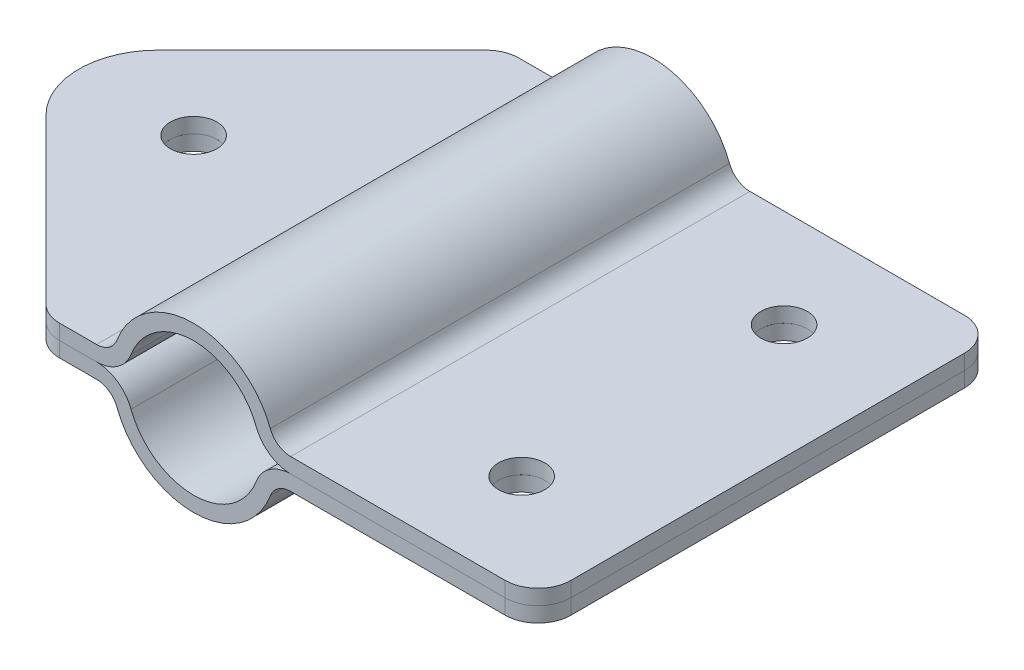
ISO-10303-21;
HEADER;
FILE_DESCRIPTION(('STEP AP214'),'2;1');
FILE_NAME('part.step','',(''),(''),'','','');
FILE_SCHEMA(('AUTOMOTIVE_DESIGN { 1 0 10303 214 1 1 1 1 }'));
ENDSEC;
DATA;
#1=APPLICATION_CONTEXT('core data for automotive mechanical design processes');
#2=APPLICATION_PROTOCOL_DEFINITION('international standard','automotive_design',2000,#1);
#3=PRODUCT_CONTEXT('',#1,'mechanical');
#4=PRODUCT('Part','Part','',(#3));
#5=PRODUCT_RELATED_PRODUCT_CATEGORY('part','',(#4));
#6=PRODUCT_DEFINITION_FORMATION('','',#4);
#7=PRODUCT_DEFINITION_CONTEXT('part definition',#1,'design');
#8=PRODUCT_DEFINITION('design','',#6,#7);
#9=PRODUCT_DEFINITION_SHAPE('','',#8);
#10=(LENGTH_UNIT() NAMED_UNIT(*) SI_UNIT(.MILLI.,.METRE.));
#11=(NAMED_UNIT(*) PLANE_ANGLE_UNIT() SI_UNIT($,.RADIAN.));
#12=(NAMED_UNIT(*) SI_UNIT($,.STERADIAN.) SOLID_ANGLE_UNIT());
#13=UNCERTAINTY_MEASURE_WITH_UNIT(LENGTH_MEASURE(1.E-05),#10,'distance_accuracy_value','');
#14=(GEOMETRIC_REPRESENTATION_CONTEXT(3) GLOBAL_UNCERTAINTY_ASSIGNED_CONTEXT((#13)) GLOBAL_UNIT_ASSIGNED_CONTEXT((#10,
#11,#12)) REPRESENTATION_CONTEXT('',''));
#15=CARTESIAN_POINT('',(0.,0.,0.));
#16=DIRECTION('',(0.,0.,1.));
#17=DIRECTION('',(1.,0.,0.));
#18=AXIS2_PLACEMENT_3D('',#15,#16,#17);
#19=CARTESIAN_POINT('',(-25.6723719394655,0.,0.));
#20=DIRECTION('',(0.,1.,0.));
#21=DIRECTION('',(0.,0.,1.));
#22=AXIS2_PLACEMENT_3D('',#19,#20,#21);
#23=CYLINDRICAL_SURFACE('',#22,7.66512806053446);
#24=DIRECTION('',(0.,1.,0.));
#25=VECTOR('',#24,1.);
#26=CARTESIAN_POINT('',(-31.0924359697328,0.,5.42006403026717));
#27=LINE('',#26,#25);
#28=CARTESIAN_POINT('',(-31.0924359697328,0.,5.42006403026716));
#29=VERTEX_POINT('',#28);
#30=CARTESIAN_POINT('',(-31.0924359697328,-1.46049999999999,5.42006403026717));
#31=VERTEX_POINT('',#30);
#32=EDGE_CURVE('P0_E217',#29,#31,#27,.F.);
#33=ORIENTED_EDGE('',*,*,#32,.F.);
#34=CARTESIAN_POINT('',(-25.6723719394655,0.,0.));
#35=DIRECTION('',(0.,-1.,0.));
#36=DIRECTION('',(-1.,0.,0.));
#37=AXIS2_PLACEMENT_3D('',#34,#35,#36);
#38=CIRCLE('',#37,7.66512806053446);
#39=CARTESIAN_POINT('',(-31.0924359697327,0.,-5.42006403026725));
#40=VERTEX_POINT('',#39);
#41=EDGE_CURVE('P0_E223',#40,#29,#38,.F.);
#42=ORIENTED_EDGE('',*,*,#41,.F.);
#43=DIRECTION('',(0.,-1.,0.));
#44=VECTOR('',#43,1.);
#45=CARTESIAN_POINT('',(-31.0924359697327,0.,-5.42006403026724));
#46=LINE('',#45,#44);
#47=CARTESIAN_POINT('',(-31.0924359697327,-1.46049999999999,-5.42006403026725));
#48=VERTEX_POINT('',#47);
#49=EDGE_CURVE('P0_E220',#48,#40,#46,.F.);
#50=ORIENTED_EDGE('',*,*,#49,.F.);
#51=CARTESIAN_POINT('',(-25.6723719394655,-1.46049999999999,0.));
#52=DIRECTION('',(0.,-1.,0.));
#53=DIRECTION('',(-1.,0.,0.));
#54=AXIS2_PLACEMENT_3D('',#51,#52,#53);
#55=CIRCLE('',#54,7.66512806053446);
#56=EDGE_CURVE('P0_E225',#31,#48,#55,.T.);
#57=ORIENTED_EDGE('',*,*,#56,.F.);
#58=EDGE_LOOP('',(#33,#42,#50,#57));
#59=FACE_BOUND('',#58,.T.);
#60=ADVANCED_FACE('P0_F18',(#59),#23,.T.);
#61=CARTESIAN_POINT('',(6.477,0.,-22.225));
#62=DIRECTION('',(0.,-1.,0.));
#63=DIRECTION('',(-1.,0.,0.));
#64=AXIS2_PLACEMENT_3D('',#61,#62,#63);
#65=PLANE('',#64);
#66=CARTESIAN_POINT('',(22.225,0.,12.7));
#67=DIRECTION('',(0.,-1.,0.));
#68=DIRECTION('',(0.,0.,-1.));
#69=AXIS2_PLACEMENT_3D('',#66,#67,#68);
#70=CIRCLE('',#69,2.2479);
#71=CARTESIAN_POINT('',(22.225,0.,10.4521));
#72=VERTEX_POINT('',#71);
#73=EDGE_CURVE('P0_E468',#72,#72,#70,.T.);
#74=ORIENTED_EDGE('',*,*,#73,.T.);
#75=EDGE_LOOP('',(#74));
#76=FACE_BOUND('',#75,.T.);
#77=CARTESIAN_POINT('',(22.225,0.,-12.7));
#78=DIRECTION('',(0.,-1.,0.));
#79=DIRECTION('',(0.,0.,-1.));
#80=AXIS2_PLACEMENT_3D('',#77,#78,#79);
#81=CIRCLE('',#80,2.2479);
#82=CARTESIAN_POINT('',(22.225,0.,-14.9479));
#83=VERTEX_POINT('',#82);
#84=EDGE_CURVE('P0_E478',#83,#83,#81,.T.);
#85=ORIENTED_EDGE('',*,*,#84,.T.);
#86=EDGE_LOOP('',(#85));
#87=FACE_BOUND('',#86,.T.);
#88=DIRECTION('',(0.,0.,1.));
#89=VECTOR('',#88,1.);
#90=CARTESIAN_POINT('',(33.3375,0.,-22.225));
#91=LINE('',#90,#89);
#92=CARTESIAN_POINT('',(33.3375,0.,-19.05));
#93=VERTEX_POINT('',#92);
#94=CARTESIAN_POINT('',(33.3375,0.,19.05));
#95=VERTEX_POINT('',#94);
#96=EDGE_CURVE('P0_E172',#93,#95,#91,.T.);
#97=ORIENTED_EDGE('',*,*,#96,.F.);
#98=CARTESIAN_POINT('',(30.1625,0.,-19.05));
#99=DIRECTION('',(0.,-1.,0.));
#100=DIRECTION('',(-1.,0.,0.));
#101=AXIS2_PLACEMENT_3D('',#98,#99,#100);
#102=CIRCLE('',#101,3.175);
#103=CARTESIAN_POINT('',(30.1625,0.,-22.225));
#104=VERTEX_POINT('',#103);
#105=EDGE_CURVE('P0_E41',#93,#104,#102,.F.);
#106=ORIENTED_EDGE('',*,*,#105,.T.);
#107=DIRECTION('',(1.,0.,0.));
#108=VECTOR('',#107,1.);
#109=CARTESIAN_POINT('',(6.477,0.,-22.225));
#110=LINE('',#109,#108);
#111=CARTESIAN_POINT('',(9.39263529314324,0.,-22.225));
#112=VERTEX_POINT('',#111);
#113=EDGE_CURVE('P0_E274',#112,#104,#110,.T.);
#114=ORIENTED_EDGE('',*,*,#113,.F.);
#115=DIRECTION('',(0.,0.,1.));
#116=VECTOR('',#115,1.);
#117=CARTESIAN_POINT('',(9.39263529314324,0.,-22.225));
#118=LINE('',#117,#116);
#119=CARTESIAN_POINT('',(9.39263529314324,0.,22.225));
#120=VERTEX_POINT('',#119);
#121=EDGE_CURVE('P0_E183',#112,#120,#118,.T.);
#122=ORIENTED_EDGE('',*,*,#121,.T.);
#123=DIRECTION('',(1.,0.,0.));
#124=VECTOR('',#123,1.);
#125=CARTESIAN_POINT('',(6.477,0.,22.225));
#126=LINE('',#125,#124);
#127=CARTESIAN_POINT('',(30.1625,0.,22.225));
#128=VERTEX_POINT('',#127);
#129=EDGE_CURVE('P0_E267',#120,#128,#126,.T.);
#130=ORIENTED_EDGE('',*,*,#129,.T.);
#131=CARTESIAN_POINT('',(30.1625,0.,19.05));
#132=DIRECTION('',(0.,-1.,0.));
#133=DIRECTION('',(-1.,0.,0.));
#134=AXIS2_PLACEMENT_3D('',#131,#132,#133);
#135=CIRCLE('',#134,3.175);
#136=EDGE_CURVE('P0_E33',#128,#95,#135,.F.);
#137=ORIENTED_EDGE('',*,*,#136,.T.);
#138=EDGE_LOOP('',(#97,#106,#114,#122,#130,#137));
#139=FACE_BOUND('',#138,.T.);
#140=ADVANCED_FACE('P0_F271',(#76,#87,#139),#65,.F.);
#141=CARTESIAN_POINT('',(33.3375,-1.4605,-22.225));
#142=DIRECTION('',(1.,0.,0.));
#143=DIRECTION('',(0.,0.,1.));
#144=AXIS2_PLACEMENT_3D('',#141,#142,#143);
#145=PLANE('',#144);
#146=DIRECTION('',(0.,0.,1.));
#147=VECTOR('',#146,1.);
#148=CARTESIAN_POINT('',(33.3375,-1.4605,-22.225));
#149=LINE('',#148,#147);
#150=CARTESIAN_POINT('',(33.3375,-1.4605,-19.05));
#151=VERTEX_POINT('',#150);
#152=CARTESIAN_POINT('',(33.3375,-1.4605,19.05));
#153=VERTEX_POINT('',#152);
#154=EDGE_CURVE('P0_E176',#151,#153,#149,.T.);
#155=ORIENTED_EDGE('',*,*,#154,.F.);
#156=DIRECTION('',(0.,1.,0.));
#157=VECTOR('',#156,1.);
#158=CARTESIAN_POINT('',(33.3375,-1.4605,-19.05));
#159=LINE('',#158,#157);
#160=EDGE_CURVE('P0_E251',#151,#93,#159,.T.);
#161=ORIENTED_EDGE('',*,*,#160,.T.);
#162=ORIENTED_EDGE('',*,*,#96,.T.);
#163=DIRECTION('',(0.,1.,0.));
#164=VECTOR('',#163,1.);
#165=CARTESIAN_POINT('',(33.3375,-1.4605,19.05));
#166=LINE('',#165,#164);
#167=EDGE_CURVE('P0_E249',#95,#153,#166,.F.);
#168=ORIENTED_EDGE('',*,*,#167,.T.);
#169=EDGE_LOOP('',(#155,#161,#162,#168));
#170=FACE_BOUND('',#169,.T.);
#171=ADVANCED_FACE('P0_F270',(#170),#145,.T.);
#172=CARTESIAN_POINT('',(6.477,-1.4605,-22.225));
#173=DIRECTION('',(0.,-1.,0.));
#174=DIRECTION('',(-1.,0.,0.));
#175=AXIS2_PLACEMENT_3D('',#172,#173,#174);
#176=PLANE('',#175);
#177=CARTESIAN_POINT('',(22.225,-1.4605,12.7));
#178=DIRECTION('',(0.,-1.,0.));
#179=DIRECTION('',(0.,0.,-1.));
#180=AXIS2_PLACEMENT_3D('',#177,#178,#179);
#181=CIRCLE('',#180,2.24789999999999);
#182=CARTESIAN_POINT('',(22.225,-1.4605,10.4521));
#183=VERTEX_POINT('',#182);
#184=EDGE_CURVE('P0_E471',#183,#183,#181,.T.);
#185=ORIENTED_EDGE('',*,*,#184,.F.);
#186=EDGE_LOOP('',(#185));
#187=FACE_BOUND('',#186,.T.);
#188=CARTESIAN_POINT('',(22.225,-1.4605,-12.7));
#189=DIRECTION('',(0.,-1.,0.));
#190=DIRECTION('',(0.,0.,-1.));
#191=AXIS2_PLACEMENT_3D('',#188,#189,#190);
#192=CIRCLE('',#191,2.24789999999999);
#193=CARTESIAN_POINT('',(22.225,-1.4605,-14.9479));
#194=VERTEX_POINT('',#193);
#195=EDGE_CURVE('P0_E473',#194,#194,#192,.T.);
#196=ORIENTED_EDGE('',*,*,#195,.F.);
#197=EDGE_LOOP('',(#196));
#198=FACE_BOUND('',#197,.T.);
#199=DIRECTION('',(1.,0.,0.));
#200=VECTOR('',#199,1.);
#201=CARTESIAN_POINT('',(6.477,-1.4605,-22.225));
#202=LINE('',#201,#200);
#203=CARTESIAN_POINT('',(9.39263529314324,-1.4605,-22.225));
#204=VERTEX_POINT('',#203);
#205=CARTESIAN_POINT('',(30.1625,-1.4605,-22.225));
#206=VERTEX_POINT('',#205);
#207=EDGE_CURVE('P0_E282',#204,#206,#202,.T.);
#208=ORIENTED_EDGE('',*,*,#207,.T.);
#209=CARTESIAN_POINT('',(30.1625,-1.4605,-19.05));
#210=DIRECTION('',(0.,-1.,0.));
#211=DIRECTION('',(-1.,0.,0.));
#212=AXIS2_PLACEMENT_3D('',#209,#210,#211);
#213=CIRCLE('',#212,3.175);
#214=EDGE_CURVE('P0_E12',#206,#151,#213,.T.);
#215=ORIENTED_EDGE('',*,*,#214,.T.);
#216=ORIENTED_EDGE('',*,*,#154,.T.);
#217=CARTESIAN_POINT('',(30.1625,-1.4605,19.05));
#218=DIRECTION('',(0.,-1.,0.));
#219=DIRECTION('',(-1.,0.,0.));
#220=AXIS2_PLACEMENT_3D('',#217,#218,#219);
#221=CIRCLE('',#220,3.175);
#222=CARTESIAN_POINT('',(30.1625,-1.4605,22.225));
#223=VERTEX_POINT('',#222);
#224=EDGE_CURVE('P0_E26',#153,#223,#221,.T.);
#225=ORIENTED_EDGE('',*,*,#224,.T.);
#226=DIRECTION('',(1.,0.,0.));
#227=VECTOR('',#226,1.);
#228=CARTESIAN_POINT('',(6.477,-1.4605,22.225));
#229=LINE('',#228,#227);
#230=CARTESIAN_POINT('',(9.39263529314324,-1.4605,22.225));
#231=VERTEX_POINT('',#230);
#232=EDGE_CURVE('P0_E167',#231,#223,#229,.T.);
#233=ORIENTED_EDGE('',*,*,#232,.F.);
#234=DIRECTION('',(0.,0.,-1.));
#235=VECTOR('',#234,1.);
#236=CARTESIAN_POINT('',(9.39263529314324,-1.4605,-22.225));
#237=LINE('',#236,#235);
#238=EDGE_CURVE('P0_E174',#231,#204,#237,.T.);
#239=ORIENTED_EDGE('',*,*,#238,.T.);
#240=EDGE_LOOP('',(#208,#215,#216,#225,#233,#239));
#241=FACE_BOUND('',#240,.T.);
#242=ADVANCED_FACE('P0_F260',(#187,#198,#241),#176,.T.);
#243=CARTESIAN_POINT('',(0.,0.,-22.225));
#244=DIRECTION('',(0.,0.,1.));
#245=DIRECTION('',(-1.,0.,0.));
#246=AXIS2_PLACEMENT_3D('',#243,#244,#245);
#247=CYLINDRICAL_SURFACE('',#246,7.9375);
#248=CARTESIAN_POINT('',(0.,0.,-22.225));
#249=DIRECTION('',(0.,0.,-1.));
#250=DIRECTION('',(1.,0.,0.));
#251=AXIS2_PLACEMENT_3D('',#248,#249,#250);
#252=CIRCLE('',#251,7.9375);
#253=CARTESIAN_POINT('',(-7.41914320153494,-2.82138625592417,-22.225));
#254=VERTEX_POINT('',#253);
#255=CARTESIAN_POINT('',(7.41914320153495,-2.82138625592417,-22.225));
#256=VERTEX_POINT('',#255);
#257=EDGE_CURVE('P0_E288',#254,#256,#252,.F.);
#258=ORIENTED_EDGE('',*,*,#257,.T.);
#259=DIRECTION('',(0.,0.,1.));
#260=VECTOR('',#259,1.);
#261=CARTESIAN_POINT('',(7.41914320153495,-2.82138625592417,-22.225));
#262=LINE('',#261,#260);
#263=CARTESIAN_POINT('',(7.41914320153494,-2.82138625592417,22.225));
#264=VERTEX_POINT('',#263);
#265=EDGE_CURVE('P0_E166',#256,#264,#262,.T.);
#266=ORIENTED_EDGE('',*,*,#265,.T.);
#267=CARTESIAN_POINT('',(0.,0.,22.225));
#268=DIRECTION('',(0.,0.,-1.));
#269=DIRECTION('',(1.,0.,0.));
#270=AXIS2_PLACEMENT_3D('',#267,#268,#269);
#271=CIRCLE('',#270,7.9375);
#272=CARTESIAN_POINT('',(-7.41914320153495,-2.82138625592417,22.225));
#273=VERTEX_POINT('',#272);
#274=EDGE_CURVE('P0_E148',#273,#264,#271,.F.);
#275=ORIENTED_EDGE('',*,*,#274,.F.);
#276=DIRECTION('',(0.,0.,1.));
#277=VECTOR('',#276,1.);
#278=CARTESIAN_POINT('',(-7.41914320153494,-2.82138625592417,-22.225));
#279=LINE('',#278,#277);
#280=EDGE_CURVE('P0_E163',#273,#254,#279,.F.);
#281=ORIENTED_EDGE('',*,*,#280,.T.);
#282=EDGE_LOOP('',(#258,#266,#275,#281));
#283=FACE_BOUND('',#282,.T.);
#284=ADVANCED_FACE('P0_F162',(#283),#247,.T.);
#285=CARTESIAN_POINT('',(-6.477,-1.4605,-22.225));
#286=DIRECTION('',(0.,-1.,0.));
#287=DIRECTION('',(-1.,0.,0.));
#288=AXIS2_PLACEMENT_3D('',#285,#286,#287);
#289=PLANE('',#288);
#290=CARTESIAN_POINT('',(-22.225,-1.4605,0.));
#291=DIRECTION('',(0.,-1.,0.));
#292=DIRECTION('',(0.,0.,-1.));
#293=AXIS2_PLACEMENT_3D('',#290,#291,#292);
#294=CIRCLE('',#293,2.24789999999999);
#295=CARTESIAN_POINT('',(-22.225,-1.4605,-2.24789999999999));
#296=VERTEX_POINT('',#295);
#297=EDGE_CURVE('P0_E481',#296,#296,#294,.T.);
#298=ORIENTED_EDGE('',*,*,#297,.F.);
#299=EDGE_LOOP('',(#298));
#300=FACE_BOUND('',#299,.T.);
#301=DIRECTION('',(-0.707106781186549,0.,0.707106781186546));
#302=VECTOR('',#301,1.);
#303=CARTESIAN_POINT('',(-10.3822499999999,-1.4605,-26.13025));
#304=LINE('',#303,#302);
#305=CARTESIAN_POINT('',(-15.2174359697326,-1.4605,-21.2950640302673));
#306=VERTEX_POINT('',#305);
#307=EDGE_CURVE('P0_E209',#48,#306,#304,.F.);
#308=ORIENTED_EDGE('',*,*,#307,.T.);
#309=CARTESIAN_POINT('',(-12.9723719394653,-1.4605,-19.05));
#310=DIRECTION('',(0.,-1.,0.));
#311=DIRECTION('',(-1.,0.,0.));
#312=AXIS2_PLACEMENT_3D('',#309,#310,#311);
#313=CIRCLE('',#312,3.175);
#314=CARTESIAN_POINT('',(-12.9723719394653,-1.4605,-22.225));
#315=VERTEX_POINT('',#314);
#316=EDGE_CURVE('P0_E240',#306,#315,#313,.T.);
#317=ORIENTED_EDGE('',*,*,#316,.T.);
#318=DIRECTION('',(1.,0.,0.));
#319=VECTOR('',#318,1.);
#320=CARTESIAN_POINT('',(-6.477,-1.4605,-22.225));
#321=LINE('',#320,#319);
#322=CARTESIAN_POINT('',(-9.39263529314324,-1.4605,-22.225));
#323=VERTEX_POINT('',#322);
#324=EDGE_CURVE('P0_E290',#315,#323,#321,.T.);
#325=ORIENTED_EDGE('',*,*,#324,.T.);
#326=DIRECTION('',(0.,0.,-1.));
#327=VECTOR('',#326,1.);
#328=CARTESIAN_POINT('',(-9.39263529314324,-1.4605,22.225));
#329=LINE('',#328,#327);
#330=CARTESIAN_POINT('',(-9.39263529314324,-1.4605,22.225));
#331=VERTEX_POINT('',#330);
#332=EDGE_CURVE('P0_E181',#323,#331,#329,.F.);
#333=ORIENTED_EDGE('',*,*,#332,.T.);
#334=DIRECTION('',(1.,0.,0.));
#335=VECTOR('',#334,1.);
#336=CARTESIAN_POINT('',(-6.477,-1.4605,22.225));
#337=LINE('',#336,#335);
#338=CARTESIAN_POINT('',(-12.9723719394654,-1.4605,22.225));
#339=VERTEX_POINT('',#338);
#340=EDGE_CURVE('P0_E151',#339,#331,#337,.T.);
#341=ORIENTED_EDGE('',*,*,#340,.F.);
#342=CARTESIAN_POINT('',(-12.9723719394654,-1.4605,19.05));
#343=DIRECTION('',(0.,-1.,0.));
#344=DIRECTION('',(-1.,0.,0.));
#345=AXIS2_PLACEMENT_3D('',#342,#343,#344);
#346=CIRCLE('',#345,3.175);
#347=CARTESIAN_POINT('',(-15.2174359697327,-1.4605,21.2950640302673));
#348=VERTEX_POINT('',#347);
#349=EDGE_CURVE('P0_E238',#339,#348,#346,.T.);
#350=ORIENTED_EDGE('',*,*,#349,.T.);
#351=DIRECTION('',(-0.707106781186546,0.,-0.707106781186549));
#352=VECTOR('',#351,1.);
#353=CARTESIAN_POINT('',(-32.60725,-1.46049999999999,3.90524999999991));
#354=LINE('',#353,#352);
#355=EDGE_CURVE('P0_E207',#348,#31,#354,.T.);
#356=ORIENTED_EDGE('',*,*,#355,.T.);
#357=ORIENTED_EDGE('',*,*,#56,.T.);
#358=EDGE_LOOP('',(#308,#317,#325,#333,#341,#350,#356,#357));
#359=FACE_BOUND('',#358,.T.);
#360=ADVANCED_FACE('P0_F377',(#300,#359),#289,.T.);
#361=CARTESIAN_POINT('',(-6.477,0.,-22.225));
#362=DIRECTION('',(0.,-1.,0.));
#363=DIRECTION('',(-1.,0.,0.));
#364=AXIS2_PLACEMENT_3D('',#361,#362,#363);
#365=PLANE('',#364);
#366=CARTESIAN_POINT('',(-22.225,0.,0.));
#367=DIRECTION('',(0.,-1.,0.));
#368=DIRECTION('',(0.,0.,-1.));
#369=AXIS2_PLACEMENT_3D('',#366,#367,#368);
#370=CIRCLE('',#369,2.2479);
#371=CARTESIAN_POINT('',(-22.225,0.,-2.2479));
#372=VERTEX_POINT('',#371);
#373=EDGE_CURVE('P0_E299',#372,#372,#370,.T.);
#374=ORIENTED_EDGE('',*,*,#373,.T.);
#375=EDGE_LOOP('',(#374));
#376=FACE_BOUND('',#375,.T.);
#377=DIRECTION('',(1.,0.,0.));
#378=VECTOR('',#377,1.);
#379=CARTESIAN_POINT('',(-6.477,0.,-22.225));
#380=LINE('',#379,#378);
#381=CARTESIAN_POINT('',(-12.9723719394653,0.,-22.225));
#382=VERTEX_POINT('',#381);
#383=CARTESIAN_POINT('',(-9.39263529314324,0.,-22.225));
#384=VERTEX_POINT('',#383);
#385=EDGE_CURVE('P0_E295',#382,#384,#380,.T.);
#386=ORIENTED_EDGE('',*,*,#385,.F.);
#387=CARTESIAN_POINT('',(-12.9723719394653,0.,-19.05));
#388=DIRECTION('',(0.,-1.,0.));
#389=DIRECTION('',(-1.,0.,0.));
#390=AXIS2_PLACEMENT_3D('',#387,#388,#389);
#391=CIRCLE('',#390,3.175);
#392=CARTESIAN_POINT('',(-15.2174359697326,0.,-21.2950640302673));
#393=VERTEX_POINT('',#392);
#394=EDGE_CURVE('P0_E234',#382,#393,#391,.F.);
#395=ORIENTED_EDGE('',*,*,#394,.T.);
#396=DIRECTION('',(0.707106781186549,0.,-0.707106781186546));
#397=VECTOR('',#396,1.);
#398=CARTESIAN_POINT('',(-33.3375,0.,-3.17499999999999));
#399=LINE('',#398,#397);
#400=EDGE_CURVE('P0_E215',#393,#40,#399,.F.);
#401=ORIENTED_EDGE('',*,*,#400,.T.);
#402=ORIENTED_EDGE('',*,*,#41,.T.);
#403=DIRECTION('',(0.707106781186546,0.,0.707106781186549));
#404=VECTOR('',#403,1.);
#405=CARTESIAN_POINT('',(-14.2875,0.,22.225));
#406=LINE('',#405,#404);
#407=CARTESIAN_POINT('',(-15.2174359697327,0.,21.2950640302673));
#408=VERTEX_POINT('',#407);
#409=EDGE_CURVE('P0_E212',#29,#408,#406,.T.);
#410=ORIENTED_EDGE('',*,*,#409,.T.);
#411=CARTESIAN_POINT('',(-12.9723719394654,0.,19.05));
#412=DIRECTION('',(0.,-1.,0.));
#413=DIRECTION('',(-1.,0.,0.));
#414=AXIS2_PLACEMENT_3D('',#411,#412,#413);
#415=CIRCLE('',#414,3.175);
#416=CARTESIAN_POINT('',(-12.9723719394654,0.,22.225));
#417=VERTEX_POINT('',#416);
#418=EDGE_CURVE('P0_E232',#408,#417,#415,.F.);
#419=ORIENTED_EDGE('',*,*,#418,.T.);
#420=DIRECTION('',(1.,0.,0.));
#421=VECTOR('',#420,1.);
#422=CARTESIAN_POINT('',(-6.477,0.,22.225));
#423=LINE('',#422,#421);
#424=CARTESIAN_POINT('',(-9.39263529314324,0.,22.225));
#425=VERTEX_POINT('',#424);
#426=EDGE_CURVE('P0_E302',#417,#425,#423,.T.);
#427=ORIENTED_EDGE('',*,*,#426,.T.);
#428=DIRECTION('',(0.,0.,1.));
#429=VECTOR('',#428,1.);
#430=CARTESIAN_POINT('',(-9.39263529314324,0.,-22.225));
#431=LINE('',#430,#429);
#432=EDGE_CURVE('P0_E200',#425,#384,#431,.F.);
#433=ORIENTED_EDGE('',*,*,#432,.T.);
#434=EDGE_LOOP('',(#386,#395,#401,#402,#410,#419,#427,#433));
#435=FACE_BOUND('',#434,.T.);
#436=ADVANCED_FACE('P0_F374',(#376,#435),#365,.F.);
#437=CARTESIAN_POINT('',(0.,0.,-22.225));
#438=DIRECTION('',(0.,0.,1.));
#439=DIRECTION('',(-1.,0.,0.));
#440=AXIS2_PLACEMENT_3D('',#437,#438,#439);
#441=CYLINDRICAL_SURFACE('',#440,6.477);
#442=CARTESIAN_POINT('',(0.,0.,22.225));
#443=DIRECTION('',(0.,0.,1.));
#444=DIRECTION('',(1.,0.,0.));
#445=AXIS2_PLACEMENT_3D('',#442,#443,#444);
#446=CIRCLE('',#445,6.477);
#447=CARTESIAN_POINT('',(-6.05402085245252,-2.30225118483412,22.225));
#448=VERTEX_POINT('',#447);
#449=CARTESIAN_POINT('',(6.05402085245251,-2.30225118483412,22.225));
#450=VERTEX_POINT('',#449);
#451=EDGE_CURVE('P0_E283',#448,#450,#446,.T.);
#452=ORIENTED_EDGE('',*,*,#451,.T.);
#453=DIRECTION('',(0.,0.,1.));
#454=VECTOR('',#453,1.);
#455=CARTESIAN_POINT('',(6.05402085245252,-2.30225118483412,-22.225));
#456=LINE('',#455,#454);
#457=CARTESIAN_POINT('',(6.05402085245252,-2.30225118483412,-22.225));
#458=VERTEX_POINT('',#457);
#459=EDGE_CURVE('P0_E194',#450,#458,#456,.F.);
#460=ORIENTED_EDGE('',*,*,#459,.T.);
#461=CARTESIAN_POINT('',(0.,0.,-22.225));
#462=DIRECTION('',(0.,0.,1.));
#463=DIRECTION('',(1.,0.,0.));
#464=AXIS2_PLACEMENT_3D('',#461,#462,#463);
#465=CIRCLE('',#464,6.477);
#466=CARTESIAN_POINT('',(-6.05402085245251,-2.30225118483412,-22.225));
#467=VERTEX_POINT('',#466);
#468=EDGE_CURVE('P0_E297',#467,#458,#465,.T.);
#469=ORIENTED_EDGE('',*,*,#468,.F.);
#470=DIRECTION('',(0.,0.,1.));
#471=VECTOR('',#470,1.);
#472=CARTESIAN_POINT('',(-6.05402085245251,-2.30225118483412,-22.225));
#473=LINE('',#472,#471);
#474=EDGE_CURVE('P0_E191',#467,#448,#473,.T.);
#475=ORIENTED_EDGE('',*,*,#474,.T.);
#476=EDGE_LOOP('',(#452,#460,#469,#475));
#477=FACE_BOUND('',#476,.T.);
#478=ADVANCED_FACE('P0_F308',(#477),#441,.F.);
#479=CARTESIAN_POINT('',(0.,0.,-22.225));
#480=DIRECTION('',(0.,0.,-1.));
#481=DIRECTION('',(1.,0.,0.));
#482=AXIS2_PLACEMENT_3D('',#479,#480,#481);
#483=PLANE('',#482);
#484=ORIENTED_EDGE('',*,*,#324,.F.);
#485=DIRECTION('',(0.,-1.,0.));
#486=VECTOR('',#485,1.);
#487=CARTESIAN_POINT('',(-12.9723719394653,0.,-22.225));
#488=LINE('',#487,#486);
#489=EDGE_CURVE('P0_E229',#315,#382,#488,.F.);
#490=ORIENTED_EDGE('',*,*,#489,.T.);
#491=ORIENTED_EDGE('',*,*,#385,.T.);
#492=CARTESIAN_POINT('',(-9.39263529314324,-3.571875,-22.225));
#493=DIRECTION('',(0.,0.,-1.));
#494=DIRECTION('',(1.,0.,0.));
#495=AXIS2_PLACEMENT_3D('',#492,#493,#494);
#496=CIRCLE('',#495,3.571875);
#497=EDGE_CURVE('P0_E196',#384,#467,#496,.T.);
#498=ORIENTED_EDGE('',*,*,#497,.T.);
#499=ORIENTED_EDGE('',*,*,#468,.T.);
#500=CARTESIAN_POINT('',(9.39263529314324,-3.571875,-22.225));
#501=DIRECTION('',(0.,0.,-1.));
#502=DIRECTION('',(1.,0.,0.));
#503=AXIS2_PLACEMENT_3D('',#500,#501,#502);
#504=CIRCLE('',#503,3.571875);
#505=EDGE_CURVE('P0_E198',#458,#112,#504,.T.);
#506=ORIENTED_EDGE('',*,*,#505,.T.);
#507=ORIENTED_EDGE('',*,*,#113,.T.);
#508=DIRECTION('',(0.,1.,0.));
#509=VECTOR('',#508,1.);
#510=CARTESIAN_POINT('',(30.1625,0.,-22.225));
#511=LINE('',#510,#509);
#512=EDGE_CURVE('P0_E227',#104,#206,#511,.F.);
#513=ORIENTED_EDGE('',*,*,#512,.T.);
#514=ORIENTED_EDGE('',*,*,#207,.F.);
#515=CARTESIAN_POINT('',(9.39263529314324,-3.571875,-22.225));
#516=DIRECTION('',(0.,0.,-1.));
#517=DIRECTION('',(1.,0.,0.));
#518=AXIS2_PLACEMENT_3D('',#515,#516,#517);
#519=CIRCLE('',#518,2.111375);
#520=EDGE_CURVE('P0_E157',#204,#256,#519,.F.);
#521=ORIENTED_EDGE('',*,*,#520,.T.);
#522=ORIENTED_EDGE('',*,*,#257,.F.);
#523=CARTESIAN_POINT('',(-9.39263529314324,-3.571875,-22.225));
#524=DIRECTION('',(0.,0.,-1.));
#525=DIRECTION('',(1.,0.,0.));
#526=AXIS2_PLACEMENT_3D('',#523,#524,#525);
#527=CIRCLE('',#526,2.111375);
#528=EDGE_CURVE('P0_E156',#254,#323,#527,.F.);
#529=ORIENTED_EDGE('',*,*,#528,.T.);
#530=EDGE_LOOP('',(#484,#490,#491,#498,#499,#506,#507,#513,#514,#521,#522,#529));
#531=FACE_BOUND('',#530,.T.);
#532=ADVANCED_FACE('P0_F278',(#531),#483,.T.);
#533=CARTESIAN_POINT('',(0.,0.,22.225));
#534=DIRECTION('',(0.,0.,-1.));
#535=DIRECTION('',(1.,0.,0.));
#536=AXIS2_PLACEMENT_3D('',#533,#534,#535);
#537=PLANE('',#536);
#538=ORIENTED_EDGE('',*,*,#426,.F.);
#539=DIRECTION('',(0.,-1.,0.));
#540=VECTOR('',#539,1.);
#541=CARTESIAN_POINT('',(-12.9723719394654,-1.4605,22.225));
#542=LINE('',#541,#540);
#543=EDGE_CURVE('P0_E245',#417,#339,#542,.T.);
#544=ORIENTED_EDGE('',*,*,#543,.T.);
#545=ORIENTED_EDGE('',*,*,#340,.T.);
#546=CARTESIAN_POINT('',(-9.39263529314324,-3.571875,22.225));
#547=DIRECTION('',(0.,0.,-1.));
#548=DIRECTION('',(1.,0.,0.));
#549=AXIS2_PLACEMENT_3D('',#546,#547,#548);
#550=CIRCLE('',#549,2.111375);
#551=EDGE_CURVE('P0_E144',#331,#273,#550,.T.);
#552=ORIENTED_EDGE('',*,*,#551,.T.);
#553=ORIENTED_EDGE('',*,*,#274,.T.);
#554=CARTESIAN_POINT('',(9.39263529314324,-3.571875,22.225));
#555=DIRECTION('',(0.,0.,-1.));
#556=DIRECTION('',(1.,0.,0.));
#557=AXIS2_PLACEMENT_3D('',#554,#555,#556);
#558=CIRCLE('',#557,2.111375);
#559=EDGE_CURVE('P0_E203',#264,#231,#558,.T.);
#560=ORIENTED_EDGE('',*,*,#559,.T.);
#561=ORIENTED_EDGE('',*,*,#232,.T.);
#562=DIRECTION('',(0.,1.,0.));
#563=VECTOR('',#562,1.);
#564=CARTESIAN_POINT('',(30.1625,0.,22.225));
#565=LINE('',#564,#563);
#566=EDGE_CURVE('P0_E242',#223,#128,#565,.T.);
#567=ORIENTED_EDGE('',*,*,#566,.T.);
#568=ORIENTED_EDGE('',*,*,#129,.F.);
#569=CARTESIAN_POINT('',(9.39263529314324,-3.571875,22.225));
#570=DIRECTION('',(0.,0.,-1.));
#571=DIRECTION('',(1.,0.,0.));
#572=AXIS2_PLACEMENT_3D('',#569,#570,#571);
#573=CIRCLE('',#572,3.571875);
#574=EDGE_CURVE('P0_E189',#120,#450,#573,.F.);
#575=ORIENTED_EDGE('',*,*,#574,.T.);
#576=ORIENTED_EDGE('',*,*,#451,.F.);
#577=CARTESIAN_POINT('',(-9.39263529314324,-3.571875,22.225));
#578=DIRECTION('',(0.,0.,-1.));
#579=DIRECTION('',(1.,0.,0.));
#580=AXIS2_PLACEMENT_3D('',#577,#578,#579);
#581=CIRCLE('',#580,3.571875);
#582=EDGE_CURVE('P0_E186',#448,#425,#581,.F.);
#583=ORIENTED_EDGE('',*,*,#582,.T.);
#584=EDGE_LOOP('',(#538,#544,#545,#552,#553,#560,#561,#567,#568,#575,#576,#583));
#585=FACE_BOUND('',#584,.T.);
#586=ADVANCED_FACE('P0_F147',(#585),#537,.F.);
#587=CARTESIAN_POINT('',(9.39263529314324,-3.571875,-22.225));
#588=DIRECTION('',(0.,0.,1.));
#589=DIRECTION('',(-1.,0.,0.));
#590=AXIS2_PLACEMENT_3D('',#587,#588,#589);
#591=CYLINDRICAL_SURFACE('',#590,2.111375);
#592=ORIENTED_EDGE('',*,*,#520,.F.);
#593=ORIENTED_EDGE('',*,*,#238,.F.);
#594=ORIENTED_EDGE('',*,*,#559,.F.);
#595=ORIENTED_EDGE('',*,*,#265,.F.);
#596=EDGE_LOOP('',(#592,#593,#594,#595));
#597=FACE_BOUND('',#596,.T.);
#598=ADVANCED_FACE('P0_F324',(#597),#591,.F.);
#599=CARTESIAN_POINT('',(-9.39263529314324,-3.571875,-22.225));
#600=DIRECTION('',(0.,0.,1.));
#601=DIRECTION('',(-1.,0.,0.));
#602=AXIS2_PLACEMENT_3D('',#599,#600,#601);
#603=CYLINDRICAL_SURFACE('',#602,2.111375);
#604=ORIENTED_EDGE('',*,*,#528,.F.);
#605=ORIENTED_EDGE('',*,*,#280,.F.);
#606=ORIENTED_EDGE('',*,*,#551,.F.);
#607=ORIENTED_EDGE('',*,*,#332,.F.);
#608=EDGE_LOOP('',(#604,#605,#606,#607));
#609=FACE_BOUND('',#608,.T.);
#610=ADVANCED_FACE('P0_F170',(#609),#603,.F.);
#611=CARTESIAN_POINT('',(9.39263529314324,-3.571875,-22.225));
#612=DIRECTION('',(0.,0.,1.));
#613=DIRECTION('',(-1.,0.,0.));
#614=AXIS2_PLACEMENT_3D('',#611,#612,#613);
#615=CYLINDRICAL_SURFACE('',#614,3.571875);
#616=ORIENTED_EDGE('',*,*,#505,.F.);
#617=ORIENTED_EDGE('',*,*,#459,.F.);
#618=ORIENTED_EDGE('',*,*,#574,.F.);
#619=ORIENTED_EDGE('',*,*,#121,.F.);
#620=EDGE_LOOP('',(#616,#617,#618,#619));
#621=FACE_BOUND('',#620,.T.);
#622=ADVANCED_FACE('P0_F312',(#621),#615,.T.);
#623=CARTESIAN_POINT('',(-9.39263529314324,-3.571875,-22.225));
#624=DIRECTION('',(0.,0.,1.));
#625=DIRECTION('',(-1.,0.,0.));
#626=AXIS2_PLACEMENT_3D('',#623,#624,#625);
#627=CYLINDRICAL_SURFACE('',#626,3.571875);
#628=ORIENTED_EDGE('',*,*,#497,.F.);
#629=ORIENTED_EDGE('',*,*,#432,.F.);
#630=ORIENTED_EDGE('',*,*,#582,.F.);
#631=ORIENTED_EDGE('',*,*,#474,.F.);
#632=EDGE_LOOP('',(#628,#629,#630,#631));
#633=FACE_BOUND('',#632,.T.);
#634=ADVANCED_FACE('P0_F314',(#633),#627,.T.);
#635=CARTESIAN_POINT('',(-33.3375,0.,-3.17499999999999));
#636=DIRECTION('',(0.707106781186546,0.,0.707106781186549));
#637=DIRECTION('',(-0.707106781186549,0.,0.707106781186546));
#638=AXIS2_PLACEMENT_3D('',#635,#636,#637);
#639=PLANE('',#638);
#640=ORIENTED_EDGE('',*,*,#400,.F.);
#641=DIRECTION('',(0.,1.,0.));
#642=VECTOR('',#641,1.);
#643=CARTESIAN_POINT('',(-15.2174359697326,0.,-21.2950640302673));
#644=LINE('',#643,#642);
#645=EDGE_CURVE('P0_E236',#393,#306,#644,.F.);
#646=ORIENTED_EDGE('',*,*,#645,.T.);
#647=ORIENTED_EDGE('',*,*,#307,.F.);
#648=ORIENTED_EDGE('',*,*,#49,.T.);
#649=EDGE_LOOP('',(#640,#646,#647,#648));
#650=FACE_BOUND('',#649,.T.);
#651=ADVANCED_FACE('P0_F321',(#650),#639,.F.);
#652=CARTESIAN_POINT('',(-14.2875,0.,22.225));
#653=DIRECTION('',(-0.707106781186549,0.,0.707106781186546));
#654=DIRECTION('',(-0.707106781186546,0.,-0.707106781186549));
#655=AXIS2_PLACEMENT_3D('',#652,#653,#654);
#656=PLANE('',#655);
#657=ORIENTED_EDGE('',*,*,#355,.F.);
#658=DIRECTION('',(0.,-1.,0.));
#659=VECTOR('',#658,1.);
#660=CARTESIAN_POINT('',(-15.2174359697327,0.,21.2950640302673));
#661=LINE('',#660,#659);
#662=EDGE_CURVE('P0_E247',#348,#408,#661,.F.);
#663=ORIENTED_EDGE('',*,*,#662,.T.);
#664=ORIENTED_EDGE('',*,*,#409,.F.);
#665=ORIENTED_EDGE('',*,*,#32,.T.);
#666=EDGE_LOOP('',(#657,#663,#664,#665));
#667=FACE_BOUND('',#666,.T.);
#668=ADVANCED_FACE('P0_F338',(#667),#656,.T.);
#669=CARTESIAN_POINT('',(-12.9723719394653,0.,-19.05));
#670=DIRECTION('',(0.,-1.,0.));
#671=DIRECTION('',(0.,0.,-1.));
#672=AXIS2_PLACEMENT_3D('',#669,#670,#671);
#673=CYLINDRICAL_SURFACE('',#672,3.175);
#674=ORIENTED_EDGE('',*,*,#316,.F.);
#675=ORIENTED_EDGE('',*,*,#645,.F.);
#676=ORIENTED_EDGE('',*,*,#394,.F.);
#677=ORIENTED_EDGE('',*,*,#489,.F.);
#678=EDGE_LOOP('',(#674,#675,#676,#677));
#679=FACE_BOUND('',#678,.T.);
#680=ADVANCED_FACE('P0_F340',(#679),#673,.T.);
#681=CARTESIAN_POINT('',(-12.9723719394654,0.,19.05));
#682=DIRECTION('',(0.,1.,0.));
#683=DIRECTION('',(0.,0.,1.));
#684=AXIS2_PLACEMENT_3D('',#681,#682,#683);
#685=CYLINDRICAL_SURFACE('',#684,3.175);
#686=ORIENTED_EDGE('',*,*,#418,.F.);
#687=ORIENTED_EDGE('',*,*,#662,.F.);
#688=ORIENTED_EDGE('',*,*,#349,.F.);
#689=ORIENTED_EDGE('',*,*,#543,.F.);
#690=EDGE_LOOP('',(#686,#687,#688,#689));
#691=FACE_BOUND('',#690,.T.);
#692=ADVANCED_FACE('P0_F343',(#691),#685,.T.);
#693=CARTESIAN_POINT('',(30.1625,-1.4605,-19.05));
#694=DIRECTION('',(0.,1.,0.));
#695=DIRECTION('',(0.,0.,1.));
#696=AXIS2_PLACEMENT_3D('',#693,#694,#695);
#697=CYLINDRICAL_SURFACE('',#696,3.175);
#698=ORIENTED_EDGE('',*,*,#214,.F.);
#699=ORIENTED_EDGE('',*,*,#512,.F.);
#700=ORIENTED_EDGE('',*,*,#105,.F.);
#701=ORIENTED_EDGE('',*,*,#160,.F.);
#702=EDGE_LOOP('',(#698,#699,#700,#701));
#703=FACE_BOUND('',#702,.T.);
#704=ADVANCED_FACE('P0_F286',(#703),#697,.T.);
#705=CARTESIAN_POINT('',(30.1625,0.,19.05));
#706=DIRECTION('',(0.,-1.,0.));
#707=DIRECTION('',(0.,0.,-1.));
#708=AXIS2_PLACEMENT_3D('',#705,#706,#707);
#709=CYLINDRICAL_SURFACE('',#708,3.175);
#710=ORIENTED_EDGE('',*,*,#224,.F.);
#711=ORIENTED_EDGE('',*,*,#167,.F.);
#712=ORIENTED_EDGE('',*,*,#136,.F.);
#713=ORIENTED_EDGE('',*,*,#566,.F.);
#714=EDGE_LOOP('',(#710,#711,#712,#713));
#715=FACE_BOUND('',#714,.T.);
#716=ADVANCED_FACE('P0_F20',(#715),#709,.T.);
#717=CARTESIAN_POINT('',(-22.225,-1.4605,0.));
#718=DIRECTION('',(0.,-1.,0.));
#719=DIRECTION('',(0.,0.,-1.));
#720=AXIS2_PLACEMENT_3D('',#717,#718,#719);
#721=CYLINDRICAL_SURFACE('',#720,2.24789999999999);
#722=ORIENTED_EDGE('',*,*,#373,.F.);
#723=EDGE_LOOP('',(#722));
#724=FACE_BOUND('',#723,.T.);
#725=ORIENTED_EDGE('',*,*,#297,.T.);
#726=EDGE_LOOP('',(#725));
#727=FACE_BOUND('',#726,.T.);
#728=ADVANCED_FACE('P0_F351',(#724,#727),#721,.F.);
#729=CARTESIAN_POINT('',(22.225,-1.4605,-12.7));
#730=DIRECTION('',(0.,-1.,0.));
#731=DIRECTION('',(0.,0.,-1.));
#732=AXIS2_PLACEMENT_3D('',#729,#730,#731);
#733=CYLINDRICAL_SURFACE('',#732,2.24789999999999);
#734=ORIENTED_EDGE('',*,*,#84,.F.);
#735=EDGE_LOOP('',(#734));
#736=FACE_BOUND('',#735,.T.);
#737=ORIENTED_EDGE('',*,*,#195,.T.);
#738=EDGE_LOOP('',(#737));
#739=FACE_BOUND('',#738,.T.);
#740=ADVANCED_FACE('P0_F355',(#736,#739),#733,.F.);
#741=CARTESIAN_POINT('',(22.225,-1.4605,12.7));
#742=DIRECTION('',(0.,-1.,0.));
#743=DIRECTION('',(0.,0.,-1.));
#744=AXIS2_PLACEMENT_3D('',#741,#742,#743);
#745=CYLINDRICAL_SURFACE('',#744,2.24789999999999);
#746=ORIENTED_EDGE('',*,*,#73,.F.);
#747=EDGE_LOOP('',(#746));
#748=FACE_BOUND('',#747,.T.);
#749=ORIENTED_EDGE('',*,*,#184,.T.);
#750=EDGE_LOOP('',(#749));
#751=FACE_BOUND('',#750,.T.);
#752=ADVANCED_FACE('P0_F361',(#748,#751),#745,.F.);
#753=CLOSED_SHELL('',(#60,#140,#171,#242,#284,#360,#436,#478,#532,#586,#598,#610,#622,#634,#651,
#668,#680,#692,#704,#716,#728,#740,#752));
#754=MANIFOLD_SOLID_BREP('P0_B1',#753);
#755=CARTESIAN_POINT('',(-25.6723719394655,0.,0.));
#756=DIRECTION('',(0.,-1.,0.));
#757=DIRECTION('',(0.,0.,-1.));
#758=AXIS2_PLACEMENT_3D('',#755,#756,#757);
#759=CYLINDRICAL_SURFACE('',#758,7.66512806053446);
#760=DIRECTION('',(0.,-1.,0.));
#761=VECTOR('',#760,1.);
#762=CARTESIAN_POINT('',(-31.0924359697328,0.,-5.42006403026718));
#763=LINE('',#762,#761);
#764=CARTESIAN_POINT('',(-31.0924359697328,0.,-5.42006403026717));
#765=VERTEX_POINT('',#764);
#766=CARTESIAN_POINT('',(-31.0924359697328,1.4605,-5.42006403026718));
#767=VERTEX_POINT('',#766);
#768=EDGE_CURVE('P1_E217',#765,#767,#763,.F.);
#769=ORIENTED_EDGE('',*,*,#768,.F.);
#770=CARTESIAN_POINT('',(-25.6723719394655,0.,0.));
#771=DIRECTION('',(0.,1.,0.));
#772=DIRECTION('',(-1.,0.,0.));
#773=AXIS2_PLACEMENT_3D('',#770,#771,#772);
#774=CIRCLE('',#773,7.66512806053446);
#775=CARTESIAN_POINT('',(-31.0924359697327,0.,5.42006403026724));
#776=VERTEX_POINT('',#775);
#777=EDGE_CURVE('P1_E223',#776,#765,#774,.F.);
#778=ORIENTED_EDGE('',*,*,#777,.F.);
#779=DIRECTION('',(0.,1.,0.));
#780=VECTOR('',#779,1.);
#781=CARTESIAN_POINT('',(-31.0924359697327,0.,5.42006403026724));
#782=LINE('',#781,#780);
#783=CARTESIAN_POINT('',(-31.0924359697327,1.4605,5.42006403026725));
#784=VERTEX_POINT('',#783);
#785=EDGE_CURVE('P1_E220',#784,#776,#782,.F.);
#786=ORIENTED_EDGE('',*,*,#785,.F.);
#787=CARTESIAN_POINT('',(-25.6723719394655,1.4605,0.));
#788=DIRECTION('',(0.,1.,0.));
#789=DIRECTION('',(-1.,0.,0.));
#790=AXIS2_PLACEMENT_3D('',#787,#788,#789);
#791=CIRCLE('',#790,7.66512806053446);
#792=EDGE_CURVE('P1_E225',#767,#784,#791,.T.);
#793=ORIENTED_EDGE('',*,*,#792,.F.);
#794=EDGE_LOOP('',(#769,#778,#786,#793));
#795=FACE_BOUND('',#794,.T.);
#796=ADVANCED_FACE('P1_F18',(#795),#759,.T.);
#797=CARTESIAN_POINT('',(6.477,0.,22.225));
#798=DIRECTION('',(0.,1.,0.));
#799=DIRECTION('',(-1.,0.,0.));
#800=AXIS2_PLACEMENT_3D('',#797,#798,#799);
#801=PLANE('',#800);
#802=CARTESIAN_POINT('',(22.225,0.,-12.7));
#803=DIRECTION('',(0.,1.,0.));
#804=DIRECTION('',(0.,0.,1.));
#805=AXIS2_PLACEMENT_3D('',#802,#803,#804);
#806=CIRCLE('',#805,2.2479);
#807=CARTESIAN_POINT('',(22.225,0.,-10.4521));
#808=VERTEX_POINT('',#807);
#809=EDGE_CURVE('P1_E558',#808,#808,#806,.T.);
#810=ORIENTED_EDGE('',*,*,#809,.T.);
#811=EDGE_LOOP('',(#810));
#812=FACE_BOUND('',#811,.T.);
#813=CARTESIAN_POINT('',(22.225,0.,12.7));
#814=DIRECTION('',(0.,1.,0.));
#815=DIRECTION('',(0.,0.,1.));
#816=AXIS2_PLACEMENT_3D('',#813,#814,#815);
#817=CIRCLE('',#816,2.2479);
#818=CARTESIAN_POINT('',(22.225,0.,14.9479));
#819=VERTEX_POINT('',#818);
#820=EDGE_CURVE('P1_E568',#819,#819,#817,.T.);
#821=ORIENTED_EDGE('',*,*,#820,.T.);
#822=EDGE_LOOP('',(#821));
#823=FACE_BOUND('',#822,.T.);
#824=DIRECTION('',(0.,0.,-1.));
#825=VECTOR('',#824,1.);
#826=CARTESIAN_POINT('',(33.3375,0.,22.225));
#827=LINE('',#826,#825);
#828=CARTESIAN_POINT('',(33.3375,0.,19.05));
#829=VERTEX_POINT('',#828);
#830=CARTESIAN_POINT('',(33.3375,0.,-19.05));
#831=VERTEX_POINT('',#830);
#832=EDGE_CURVE('P1_E172',#829,#831,#827,.T.);
#833=ORIENTED_EDGE('',*,*,#832,.F.);
#834=CARTESIAN_POINT('',(30.1625,0.,19.05));
#835=DIRECTION('',(0.,1.,0.));
#836=DIRECTION('',(-1.,0.,0.));
#837=AXIS2_PLACEMENT_3D('',#834,#835,#836);
#838=CIRCLE('',#837,3.175);
#839=CARTESIAN_POINT('',(30.1625,0.,22.225));
#840=VERTEX_POINT('',#839);
#841=EDGE_CURVE('P1_E41',#829,#840,#838,.F.);
#842=ORIENTED_EDGE('',*,*,#841,.T.);
#843=DIRECTION('',(1.,0.,0.));
#844=VECTOR('',#843,1.);
#845=CARTESIAN_POINT('',(6.477,0.,22.225));
#846=LINE('',#845,#844);
#847=CARTESIAN_POINT('',(9.39263529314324,0.,22.225));
#848=VERTEX_POINT('',#847);
#849=EDGE_CURVE('P1_E274',#848,#840,#846,.T.);
#850=ORIENTED_EDGE('',*,*,#849,.F.);
#851=DIRECTION('',(0.,0.,-1.));
#852=VECTOR('',#851,1.);
#853=CARTESIAN_POINT('',(9.39263529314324,0.,22.225));
#854=LINE('',#853,#852);
#855=CARTESIAN_POINT('',(9.39263529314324,0.,-22.225));
#856=VERTEX_POINT('',#855);
#857=EDGE_CURVE('P1_E183',#848,#856,#854,.T.);
#858=ORIENTED_EDGE('',*,*,#857,.T.);
#859=DIRECTION('',(1.,0.,0.));
#860=VECTOR('',#859,1.);
#861=CARTESIAN_POINT('',(6.477,0.,-22.225));
#862=LINE('',#861,#860);
#863=CARTESIAN_POINT('',(30.1625,0.,-22.225));
#864=VERTEX_POINT('',#863);
#865=EDGE_CURVE('P1_E267',#856,#864,#862,.T.);
#866=ORIENTED_EDGE('',*,*,#865,.T.);
#867=CARTESIAN_POINT('',(30.1625,0.,-19.05));
#868=DIRECTION('',(0.,1.,0.));
#869=DIRECTION('',(-1.,0.,0.));
#870=AXIS2_PLACEMENT_3D('',#867,#868,#869);
#871=CIRCLE('',#870,3.175);
#872=EDGE_CURVE('P1_E33',#864,#831,#871,.F.);
#873=ORIENTED_EDGE('',*,*,#872,.T.);
#874=EDGE_LOOP('',(#833,#842,#850,#858,#866,#873));
#875=FACE_BOUND('',#874,.T.);
#876=ADVANCED_FACE('P1_F271',(#812,#823,#875),#801,.F.);
#877=CARTESIAN_POINT('',(33.3375,1.4605,22.225));
#878=DIRECTION('',(1.,0.,0.));
#879=DIRECTION('',(0.,0.,-1.));
#880=AXIS2_PLACEMENT_3D('',#877,#878,#879);
#881=PLANE('',#880);
#882=DIRECTION('',(0.,0.,-1.));
#883=VECTOR('',#882,1.);
#884=CARTESIAN_POINT('',(33.3375,1.4605,22.225));
#885=LINE('',#884,#883);
#886=CARTESIAN_POINT('',(33.3375,1.4605,19.05));
#887=VERTEX_POINT('',#886);
#888=CARTESIAN_POINT('',(33.3375,1.4605,-19.05));
#889=VERTEX_POINT('',#888);
#890=EDGE_CURVE('P1_E176',#887,#889,#885,.T.);
#891=ORIENTED_EDGE('',*,*,#890,.F.);
#892=DIRECTION('',(0.,-1.,0.));
#893=VECTOR('',#892,1.);
#894=CARTESIAN_POINT('',(33.3375,1.4605,19.05));
#895=LINE('',#894,#893);
#896=EDGE_CURVE('P1_E251',#887,#829,#895,.T.);
#897=ORIENTED_EDGE('',*,*,#896,.T.);
#898=ORIENTED_EDGE('',*,*,#832,.T.);
#899=DIRECTION('',(0.,-1.,0.));
#900=VECTOR('',#899,1.);
#901=CARTESIAN_POINT('',(33.3375,1.4605,-19.05));
#902=LINE('',#901,#900);
#903=EDGE_CURVE('P1_E249',#831,#889,#902,.F.);
#904=ORIENTED_EDGE('',*,*,#903,.T.);
#905=EDGE_LOOP('',(#891,#897,#898,#904));
#906=FACE_BOUND('',#905,.T.);
#907=ADVANCED_FACE('P1_F270',(#906),#881,.T.);
#908=CARTESIAN_POINT('',(6.477,1.4605,22.225));
#909=DIRECTION('',(0.,1.,0.));
#910=DIRECTION('',(-1.,0.,0.));
#911=AXIS2_PLACEMENT_3D('',#908,#909,#910);
#912=PLANE('',#911);
#913=CARTESIAN_POINT('',(22.225,1.4605,-12.7));
#914=DIRECTION('',(0.,1.,0.));
#915=DIRECTION('',(0.,0.,1.));
#916=AXIS2_PLACEMENT_3D('',#913,#914,#915);
#917=CIRCLE('',#916,2.24789999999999);
#918=CARTESIAN_POINT('',(22.225,1.4605,-10.4521));
#919=VERTEX_POINT('',#918);
#920=EDGE_CURVE('P1_E561',#919,#919,#917,.T.);
#921=ORIENTED_EDGE('',*,*,#920,.F.);
#922=EDGE_LOOP('',(#921));
#923=FACE_BOUND('',#922,.T.);
#924=CARTESIAN_POINT('',(22.225,1.4605,12.7));
#925=DIRECTION('',(0.,1.,0.));
#926=DIRECTION('',(0.,0.,1.));
#927=AXIS2_PLACEMENT_3D('',#924,#925,#926);
#928=CIRCLE('',#927,2.24789999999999);
#929=CARTESIAN_POINT('',(22.225,1.4605,14.9479));
#930=VERTEX_POINT('',#929);
#931=EDGE_CURVE('P1_E563',#930,#930,#928,.T.);
#932=ORIENTED_EDGE('',*,*,#931,.F.);
#933=EDGE_LOOP('',(#932));
#934=FACE_BOUND('',#933,.T.);
#935=DIRECTION('',(1.,0.,0.));
#936=VECTOR('',#935,1.);
#937=CARTESIAN_POINT('',(6.477,1.4605,22.225));
#938=LINE('',#937,#936);
#939=CARTESIAN_POINT('',(9.39263529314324,1.4605,22.225));
#940=VERTEX_POINT('',#939);
#941=CARTESIAN_POINT('',(30.1625,1.4605,22.225));
#942=VERTEX_POINT('',#941);
#943=EDGE_CURVE('P1_E282',#940,#942,#938,.T.);
#944=ORIENTED_EDGE('',*,*,#943,.T.);
#945=CARTESIAN_POINT('',(30.1625,1.4605,19.05));
#946=DIRECTION('',(0.,1.,0.));
#947=DIRECTION('',(-1.,0.,0.));
#948=AXIS2_PLACEMENT_3D('',#945,#946,#947);
#949=CIRCLE('',#948,3.175);
#950=EDGE_CURVE('P1_E12',#942,#887,#949,.T.);
#951=ORIENTED_EDGE('',*,*,#950,.T.);
#952=ORIENTED_EDGE('',*,*,#890,.T.);
#953=CARTESIAN_POINT('',(30.1625,1.4605,-19.05));
#954=DIRECTION('',(0.,1.,0.));
#955=DIRECTION('',(-1.,0.,0.));
#956=AXIS2_PLACEMENT_3D('',#953,#954,#955);
#957=CIRCLE('',#956,3.175);
#958=CARTESIAN_POINT('',(30.1625,1.4605,-22.225));
#959=VERTEX_POINT('',#958);
#960=EDGE_CURVE('P1_E26',#889,#959,#957,.T.);
#961=ORIENTED_EDGE('',*,*,#960,.T.);
#962=DIRECTION('',(1.,0.,0.));
#963=VECTOR('',#962,1.);
#964=CARTESIAN_POINT('',(6.477,1.4605,-22.225));
#965=LINE('',#964,#963);
#966=CARTESIAN_POINT('',(9.39263529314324,1.4605,-22.225));
#967=VERTEX_POINT('',#966);
#968=EDGE_CURVE('P1_E167',#967,#959,#965,.T.);
#969=ORIENTED_EDGE('',*,*,#968,.F.);
#970=DIRECTION('',(0.,0.,1.));
#971=VECTOR('',#970,1.);
#972=CARTESIAN_POINT('',(9.39263529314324,1.4605,22.225));
#973=LINE('',#972,#971);
#974=EDGE_CURVE('P1_E174',#967,#940,#973,.T.);
#975=ORIENTED_EDGE('',*,*,#974,.T.);
#976=EDGE_LOOP('',(#944,#951,#952,#961,#969,#975));
#977=FACE_BOUND('',#976,.T.);
#978=ADVANCED_FACE('P1_F260',(#923,#934,#977),#912,.T.);
#979=CARTESIAN_POINT('',(0.,0.,22.225));
#980=DIRECTION('',(0.,0.,-1.));
#981=DIRECTION('',(-1.,0.,0.));
#982=AXIS2_PLACEMENT_3D('',#979,#980,#981);
#983=CYLINDRICAL_SURFACE('',#982,7.9375);
#984=CARTESIAN_POINT('',(0.,0.,22.225));
#985=DIRECTION('',(0.,0.,1.));
#986=DIRECTION('',(1.,0.,0.));
#987=AXIS2_PLACEMENT_3D('',#984,#985,#986);
#988=CIRCLE('',#987,7.9375);
#989=CARTESIAN_POINT('',(-7.41914320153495,2.82138625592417,22.225));
#990=VERTEX_POINT('',#989);
#991=CARTESIAN_POINT('',(7.41914320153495,2.82138625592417,22.225));
#992=VERTEX_POINT('',#991);
#993=EDGE_CURVE('P1_E288',#990,#992,#988,.F.);
#994=ORIENTED_EDGE('',*,*,#993,.T.);
#995=DIRECTION('',(0.,0.,-1.));
#996=VECTOR('',#995,1.);
#997=CARTESIAN_POINT('',(7.41914320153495,2.82138625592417,22.225));
#998=LINE('',#997,#996);
#999=CARTESIAN_POINT('',(7.41914320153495,2.82138625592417,-22.225));
#1000=VERTEX_POINT('',#999);
#1001=EDGE_CURVE('P1_E166',#992,#1000,#998,.T.);
#1002=ORIENTED_EDGE('',*,*,#1001,.T.);
#1003=CARTESIAN_POINT('',(0.,0.,-22.225));
#1004=DIRECTION('',(0.,0.,1.));
#1005=DIRECTION('',(1.,0.,0.));
#1006=AXIS2_PLACEMENT_3D('',#1003,#1004,#1005);
#1007=CIRCLE('',#1006,7.9375);
#1008=CARTESIAN_POINT('',(-7.41914320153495,2.82138625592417,-22.225));
#1009=VERTEX_POINT('',#1008);
#1010=EDGE_CURVE('P1_E148',#1009,#1000,#1007,.F.);
#1011=ORIENTED_EDGE('',*,*,#1010,.F.);
#1012=DIRECTION('',(0.,0.,-1.));
#1013=VECTOR('',#1012,1.);
#1014=CARTESIAN_POINT('',(-7.41914320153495,2.82138625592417,22.225));
#1015=LINE('',#1014,#1013);
#1016=EDGE_CURVE('P1_E163',#1009,#990,#1015,.F.);
#1017=ORIENTED_EDGE('',*,*,#1016,.T.);
#1018=EDGE_LOOP('',(#994,#1002,#1011,#1017));
#1019=FACE_BOUND('',#1018,.T.);
#1020=ADVANCED_FACE('P1_F162',(#1019),#983,.T.);
#1021=CARTESIAN_POINT('',(-6.477,1.4605,22.225));
#1022=DIRECTION('',(0.,1.,0.));
#1023=DIRECTION('',(-1.,0.,0.));
#1024=AXIS2_PLACEMENT_3D('',#1021,#1022,#1023);
#1025=PLANE('',#1024);
#1026=CARTESIAN_POINT('',(-22.225,1.46050000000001,0.));
#1027=DIRECTION('',(0.,1.,0.));
#1028=DIRECTION('',(0.,0.,1.));
#1029=AXIS2_PLACEMENT_3D('',#1026,#1027,#1028);
#1030=CIRCLE('',#1029,2.24789999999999);
#1031=CARTESIAN_POINT('',(-22.225,1.46050000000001,2.24789999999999));
#1032=VERTEX_POINT('',#1031);
#1033=EDGE_CURVE('P1_E571',#1032,#1032,#1030,.T.);
#1034=ORIENTED_EDGE('',*,*,#1033,.F.);
#1035=EDGE_LOOP('',(#1034));
#1036=FACE_BOUND('',#1035,.T.);
#1037=DIRECTION('',(-0.707106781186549,0.,-0.707106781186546));
#1038=VECTOR('',#1037,1.);
#1039=CARTESIAN_POINT('',(-10.38225,1.4605,26.13025));
#1040=LINE('',#1039,#1038);
#1041=CARTESIAN_POINT('',(-15.2174359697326,1.4605,21.2950640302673));
#1042=VERTEX_POINT('',#1041);
#1043=EDGE_CURVE('P1_E209',#784,#1042,#1040,.F.);
#1044=ORIENTED_EDGE('',*,*,#1043,.T.);
#1045=CARTESIAN_POINT('',(-12.9723719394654,1.4605,19.05));
#1046=DIRECTION('',(0.,1.,0.));
#1047=DIRECTION('',(-1.,0.,0.));
#1048=AXIS2_PLACEMENT_3D('',#1045,#1046,#1047);
#1049=CIRCLE('',#1048,3.175);
#1050=CARTESIAN_POINT('',(-12.9723719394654,1.4605,22.225));
#1051=VERTEX_POINT('',#1050);
#1052=EDGE_CURVE('P1_E240',#1042,#1051,#1049,.T.);
#1053=ORIENTED_EDGE('',*,*,#1052,.T.);
#1054=DIRECTION('',(1.,0.,0.));
#1055=VECTOR('',#1054,1.);
#1056=CARTESIAN_POINT('',(-6.477,1.4605,22.225));
#1057=LINE('',#1056,#1055);
#1058=CARTESIAN_POINT('',(-9.39263529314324,1.4605,22.225));
#1059=VERTEX_POINT('',#1058);
#1060=EDGE_CURVE('P1_E290',#1051,#1059,#1057,.T.);
#1061=ORIENTED_EDGE('',*,*,#1060,.T.);
#1062=DIRECTION('',(0.,0.,1.));
#1063=VECTOR('',#1062,1.);
#1064=CARTESIAN_POINT('',(-9.39263529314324,1.4605,-22.225));
#1065=LINE('',#1064,#1063);
#1066=CARTESIAN_POINT('',(-9.39263529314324,1.4605,-22.225));
#1067=VERTEX_POINT('',#1066);
#1068=EDGE_CURVE('P1_E181',#1059,#1067,#1065,.F.);
#1069=ORIENTED_EDGE('',*,*,#1068,.T.);
#1070=DIRECTION('',(1.,0.,0.));
#1071=VECTOR('',#1070,1.);
#1072=CARTESIAN_POINT('',(-6.477,1.4605,-22.225));
#1073=LINE('',#1072,#1071);
#1074=CARTESIAN_POINT('',(-12.9723719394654,1.4605,-22.225));
#1075=VERTEX_POINT('',#1074);
#1076=EDGE_CURVE('P1_E151',#1075,#1067,#1073,.T.);
#1077=ORIENTED_EDGE('',*,*,#1076,.F.);
#1078=CARTESIAN_POINT('',(-12.9723719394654,1.4605,-19.05));
#1079=DIRECTION('',(0.,1.,0.));
#1080=DIRECTION('',(-1.,0.,0.));
#1081=AXIS2_PLACEMENT_3D('',#1078,#1079,#1080);
#1082=CIRCLE('',#1081,3.175);
#1083=CARTESIAN_POINT('',(-15.2174359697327,1.4605,-21.2950640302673));
#1084=VERTEX_POINT('',#1083);
#1085=EDGE_CURVE('P1_E238',#1075,#1084,#1082,.T.);
#1086=ORIENTED_EDGE('',*,*,#1085,.T.);
#1087=DIRECTION('',(-0.707106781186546,0.,0.707106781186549));
#1088=VECTOR('',#1087,1.);
#1089=CARTESIAN_POINT('',(-32.60725,1.4605,-3.90524999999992));
#1090=LINE('',#1089,#1088);
#1091=EDGE_CURVE('P1_E207',#1084,#767,#1090,.T.);
#1092=ORIENTED_EDGE('',*,*,#1091,.T.);
#1093=ORIENTED_EDGE('',*,*,#792,.T.);
#1094=EDGE_LOOP('',(#1044,#1053,#1061,#1069,#1077,#1086,#1092,#1093));
#1095=FACE_BOUND('',#1094,.T.);
#1096=ADVANCED_FACE('P1_F377',(#1036,#1095),#1025,.T.);
#1097=CARTESIAN_POINT('',(-6.477,0.,22.225));
#1098=DIRECTION('',(0.,1.,0.));
#1099=DIRECTION('',(-1.,0.,0.));
#1100=AXIS2_PLACEMENT_3D('',#1097,#1098,#1099);
#1101=PLANE('',#1100);
#1102=CARTESIAN_POINT('',(-22.225,0.,0.));
#1103=DIRECTION('',(0.,1.,0.));
#1104=DIRECTION('',(0.,0.,1.));
#1105=AXIS2_PLACEMENT_3D('',#1102,#1103,#1104);
#1106=CIRCLE('',#1105,2.2479);
#1107=CARTESIAN_POINT('',(-22.225,0.,2.2479));
#1108=VERTEX_POINT('',#1107);
#1109=EDGE_CURVE('P1_E299',#1108,#1108,#1106,.T.);
#1110=ORIENTED_EDGE('',*,*,#1109,.T.);
#1111=EDGE_LOOP('',(#1110));
#1112=FACE_BOUND('',#1111,.T.);
#1113=DIRECTION('',(1.,0.,0.));
#1114=VECTOR('',#1113,1.);
#1115=CARTESIAN_POINT('',(-6.477,0.,22.225));
#1116=LINE('',#1115,#1114);
#1117=CARTESIAN_POINT('',(-12.9723719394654,0.,22.225));
#1118=VERTEX_POINT('',#1117);
#1119=CARTESIAN_POINT('',(-9.39263529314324,0.,22.225));
#1120=VERTEX_POINT('',#1119);
#1121=EDGE_CURVE('P1_E295',#1118,#1120,#1116,.T.);
#1122=ORIENTED_EDGE('',*,*,#1121,.F.);
#1123=CARTESIAN_POINT('',(-12.9723719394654,0.,19.05));
#1124=DIRECTION('',(0.,1.,0.));
#1125=DIRECTION('',(-1.,0.,0.));
#1126=AXIS2_PLACEMENT_3D('',#1123,#1124,#1125);
#1127=CIRCLE('',#1126,3.175);
#1128=CARTESIAN_POINT('',(-15.2174359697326,0.,21.2950640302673));
#1129=VERTEX_POINT('',#1128);
#1130=EDGE_CURVE('P1_E234',#1118,#1129,#1127,.F.);
#1131=ORIENTED_EDGE('',*,*,#1130,.T.);
#1132=DIRECTION('',(0.707106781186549,0.,0.707106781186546));
#1133=VECTOR('',#1132,1.);
#1134=CARTESIAN_POINT('',(-33.3375,0.,3.17499999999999));
#1135=LINE('',#1134,#1133);
#1136=EDGE_CURVE('P1_E215',#1129,#776,#1135,.F.);
#1137=ORIENTED_EDGE('',*,*,#1136,.T.);
#1138=ORIENTED_EDGE('',*,*,#777,.T.);
#1139=DIRECTION('',(0.707106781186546,0.,-0.707106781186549));
#1140=VECTOR('',#1139,1.);
#1141=CARTESIAN_POINT('',(-14.2875,0.,-22.225));
#1142=LINE('',#1141,#1140);
#1143=CARTESIAN_POINT('',(-15.2174359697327,0.,-21.2950640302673));
#1144=VERTEX_POINT('',#1143);
#1145=EDGE_CURVE('P1_E212',#765,#1144,#1142,.T.);
#1146=ORIENTED_EDGE('',*,*,#1145,.T.);
#1147=CARTESIAN_POINT('',(-12.9723719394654,0.,-19.05));
#1148=DIRECTION('',(0.,1.,0.));
#1149=DIRECTION('',(-1.,0.,0.));
#1150=AXIS2_PLACEMENT_3D('',#1147,#1148,#1149);
#1151=CIRCLE('',#1150,3.175);
#1152=CARTESIAN_POINT('',(-12.9723719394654,0.,-22.225));
#1153=VERTEX_POINT('',#1152);
#1154=EDGE_CURVE('P1_E232',#1144,#1153,#1151,.F.);
#1155=ORIENTED_EDGE('',*,*,#1154,.T.);
#1156=DIRECTION('',(1.,0.,0.));
#1157=VECTOR('',#1156,1.);
#1158=CARTESIAN_POINT('',(-6.477,0.,-22.225));
#1159=LINE('',#1158,#1157);
#1160=CARTESIAN_POINT('',(-9.39263529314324,0.,-22.225));
#1161=VERTEX_POINT('',#1160);
#1162=EDGE_CURVE('P1_E302',#1153,#1161,#1159,.T.);
#1163=ORIENTED_EDGE('',*,*,#1162,.T.);
#1164=DIRECTION('',(0.,0.,-1.));
#1165=VECTOR('',#1164,1.);
#1166=CARTESIAN_POINT('',(-9.39263529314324,0.,22.225));
#1167=LINE('',#1166,#1165);
#1168=EDGE_CURVE('P1_E200',#1161,#1120,#1167,.F.);
#1169=ORIENTED_EDGE('',*,*,#1168,.T.);
#1170=EDGE_LOOP('',(#1122,#1131,#1137,#1138,#1146,#1155,#1163,#1169));
#1171=FACE_BOUND('',#1170,.T.);
#1172=ADVANCED_FACE('P1_F374',(#1112,#1171),#1101,.F.);
#1173=CARTESIAN_POINT('',(0.,0.,22.225));
#1174=DIRECTION('',(0.,0.,-1.));
#1175=DIRECTION('',(-1.,0.,0.));
#1176=AXIS2_PLACEMENT_3D('',#1173,#1174,#1175);
#1177=CYLINDRICAL_SURFACE('',#1176,6.477);
#1178=CARTESIAN_POINT('',(0.,0.,-22.225));
#1179=DIRECTION('',(0.,0.,-1.));
#1180=DIRECTION('',(1.,0.,0.));
#1181=AXIS2_PLACEMENT_3D('',#1178,#1179,#1180);
#1182=CIRCLE('',#1181,6.477);
#1183=CARTESIAN_POINT('',(-6.05402085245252,2.30225118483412,-22.225));
#1184=VERTEX_POINT('',#1183);
#1185=CARTESIAN_POINT('',(6.05402085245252,2.30225118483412,-22.225));
#1186=VERTEX_POINT('',#1185);
#1187=EDGE_CURVE('P1_E283',#1184,#1186,#1182,.T.);
#1188=ORIENTED_EDGE('',*,*,#1187,.T.);
#1189=DIRECTION('',(0.,0.,-1.));
#1190=VECTOR('',#1189,1.);
#1191=CARTESIAN_POINT('',(6.05402085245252,2.30225118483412,22.225));
#1192=LINE('',#1191,#1190);
#1193=CARTESIAN_POINT('',(6.05402085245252,2.30225118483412,22.225));
#1194=VERTEX_POINT('',#1193);
#1195=EDGE_CURVE('P1_E194',#1186,#1194,#1192,.F.);
#1196=ORIENTED_EDGE('',*,*,#1195,.T.);
#1197=CARTESIAN_POINT('',(0.,0.,22.225));
#1198=DIRECTION('',(0.,0.,-1.));
#1199=DIRECTION('',(1.,0.,0.));
#1200=AXIS2_PLACEMENT_3D('',#1197,#1198,#1199);
#1201=CIRCLE('',#1200,6.477);
#1202=CARTESIAN_POINT('',(-6.05402085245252,2.30225118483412,22.225));
#1203=VERTEX_POINT('',#1202);
#1204=EDGE_CURVE('P1_E297',#1203,#1194,#1201,.T.);
#1205=ORIENTED_EDGE('',*,*,#1204,.F.);
#1206=DIRECTION('',(0.,0.,-1.));
#1207=VECTOR('',#1206,1.);
#1208=CARTESIAN_POINT('',(-6.05402085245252,2.30225118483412,22.225));
#1209=LINE('',#1208,#1207);
#1210=EDGE_CURVE('P1_E191',#1203,#1184,#1209,.T.);
#1211=ORIENTED_EDGE('',*,*,#1210,.T.);
#1212=EDGE_LOOP('',(#1188,#1196,#1205,#1211));
#1213=FACE_BOUND('',#1212,.T.);
#1214=ADVANCED_FACE('P1_F308',(#1213),#1177,.F.);
#1215=CARTESIAN_POINT('',(0.,0.,22.225));
#1216=DIRECTION('',(0.,0.,1.));
#1217=DIRECTION('',(1.,0.,0.));
#1218=AXIS2_PLACEMENT_3D('',#1215,#1216,#1217);
#1219=PLANE('',#1218);
#1220=ORIENTED_EDGE('',*,*,#1060,.F.);
#1221=DIRECTION('',(0.,1.,0.));
#1222=VECTOR('',#1221,1.);
#1223=CARTESIAN_POINT('',(-12.9723719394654,0.,22.225));
#1224=LINE('',#1223,#1222);
#1225=EDGE_CURVE('P1_E229',#1051,#1118,#1224,.F.);
#1226=ORIENTED_EDGE('',*,*,#1225,.T.);
#1227=ORIENTED_EDGE('',*,*,#1121,.T.);
#1228=CARTESIAN_POINT('',(-9.39263529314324,3.571875,22.225));
#1229=DIRECTION('',(0.,0.,1.));
#1230=DIRECTION('',(1.,0.,0.));
#1231=AXIS2_PLACEMENT_3D('',#1228,#1229,#1230);
#1232=CIRCLE('',#1231,3.571875);
#1233=EDGE_CURVE('P1_E196',#1120,#1203,#1232,.T.);
#1234=ORIENTED_EDGE('',*,*,#1233,.T.);
#1235=ORIENTED_EDGE('',*,*,#1204,.T.);
#1236=CARTESIAN_POINT('',(9.39263529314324,3.571875,22.225));
#1237=DIRECTION('',(0.,0.,1.));
#1238=DIRECTION('',(1.,0.,0.));
#1239=AXIS2_PLACEMENT_3D('',#1236,#1237,#1238);
#1240=CIRCLE('',#1239,3.571875);
#1241=EDGE_CURVE('P1_E198',#1194,#848,#1240,.T.);
#1242=ORIENTED_EDGE('',*,*,#1241,.T.);
#1243=ORIENTED_EDGE('',*,*,#849,.T.);
#1244=DIRECTION('',(0.,-1.,0.));
#1245=VECTOR('',#1244,1.);
#1246=CARTESIAN_POINT('',(30.1625,0.,22.225));
#1247=LINE('',#1246,#1245);
#1248=EDGE_CURVE('P1_E227',#840,#942,#1247,.F.);
#1249=ORIENTED_EDGE('',*,*,#1248,.T.);
#1250=ORIENTED_EDGE('',*,*,#943,.F.);
#1251=CARTESIAN_POINT('',(9.39263529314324,3.571875,22.225));
#1252=DIRECTION('',(0.,0.,1.));
#1253=DIRECTION('',(1.,0.,0.));
#1254=AXIS2_PLACEMENT_3D('',#1251,#1252,#1253);
#1255=CIRCLE('',#1254,2.111375);
#1256=EDGE_CURVE('P1_E157',#940,#992,#1255,.F.);
#1257=ORIENTED_EDGE('',*,*,#1256,.T.);
#1258=ORIENTED_EDGE('',*,*,#993,.F.);
#1259=CARTESIAN_POINT('',(-9.39263529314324,3.571875,22.225));
#1260=DIRECTION('',(0.,0.,1.));
#1261=DIRECTION('',(1.,0.,0.));
#1262=AXIS2_PLACEMENT_3D('',#1259,#1260,#1261);
#1263=CIRCLE('',#1262,2.111375);
#1264=EDGE_CURVE('P1_E156',#990,#1059,#1263,.F.);
#1265=ORIENTED_EDGE('',*,*,#1264,.T.);
#1266=EDGE_LOOP('',(#1220,#1226,#1227,#1234,#1235,#1242,#1243,#1249,#1250,#1257,#1258,#1265));
#1267=FACE_BOUND('',#1266,.T.);
#1268=ADVANCED_FACE('P1_F278',(#1267),#1219,.T.);
#1269=CARTESIAN_POINT('',(0.,0.,-22.225));
#1270=DIRECTION('',(0.,0.,1.));
#1271=DIRECTION('',(1.,0.,0.));
#1272=AXIS2_PLACEMENT_3D('',#1269,#1270,#1271);
#1273=PLANE('',#1272);
#1274=ORIENTED_EDGE('',*,*,#1162,.F.);
#1275=DIRECTION('',(0.,1.,0.));
#1276=VECTOR('',#1275,1.);
#1277=CARTESIAN_POINT('',(-12.9723719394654,1.4605,-22.225));
#1278=LINE('',#1277,#1276);
#1279=EDGE_CURVE('P1_E245',#1153,#1075,#1278,.T.);
#1280=ORIENTED_EDGE('',*,*,#1279,.T.);
#1281=ORIENTED_EDGE('',*,*,#1076,.T.);
#1282=CARTESIAN_POINT('',(-9.39263529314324,3.571875,-22.225));
#1283=DIRECTION('',(0.,0.,1.));
#1284=DIRECTION('',(1.,0.,0.));
#1285=AXIS2_PLACEMENT_3D('',#1282,#1283,#1284);
#1286=CIRCLE('',#1285,2.111375);
#1287=EDGE_CURVE('P1_E144',#1067,#1009,#1286,.T.);
#1288=ORIENTED_EDGE('',*,*,#1287,.T.);
#1289=ORIENTED_EDGE('',*,*,#1010,.T.);
#1290=CARTESIAN_POINT('',(9.39263529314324,3.571875,-22.225));
#1291=DIRECTION('',(0.,0.,1.));
#1292=DIRECTION('',(1.,0.,0.));
#1293=AXIS2_PLACEMENT_3D('',#1290,#1291,#1292);
#1294=CIRCLE('',#1293,2.111375);
#1295=EDGE_CURVE('P1_E203',#1000,#967,#1294,.T.);
#1296=ORIENTED_EDGE('',*,*,#1295,.T.);
#1297=ORIENTED_EDGE('',*,*,#968,.T.);
#1298=DIRECTION('',(0.,-1.,0.));
#1299=VECTOR('',#1298,1.);
#1300=CARTESIAN_POINT('',(30.1625,0.,-22.225));
#1301=LINE('',#1300,#1299);
#1302=EDGE_CURVE('P1_E242',#959,#864,#1301,.T.);
#1303=ORIENTED_EDGE('',*,*,#1302,.T.);
#1304=ORIENTED_EDGE('',*,*,#865,.F.);
#1305=CARTESIAN_POINT('',(9.39263529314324,3.571875,-22.225));
#1306=DIRECTION('',(0.,0.,1.));
#1307=DIRECTION('',(1.,0.,0.));
#1308=AXIS2_PLACEMENT_3D('',#1305,#1306,#1307);
#1309=CIRCLE('',#1308,3.571875);
#1310=EDGE_CURVE('P1_E189',#856,#1186,#1309,.F.);
#1311=ORIENTED_EDGE('',*,*,#1310,.T.);
#1312=ORIENTED_EDGE('',*,*,#1187,.F.);
#1313=CARTESIAN_POINT('',(-9.39263529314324,3.571875,-22.225));
#1314=DIRECTION('',(0.,0.,1.));
#1315=DIRECTION('',(1.,0.,0.));
#1316=AXIS2_PLACEMENT_3D('',#1313,#1314,#1315);
#1317=CIRCLE('',#1316,3.571875);
#1318=EDGE_CURVE('P1_E186',#1184,#1161,#1317,.F.);
#1319=ORIENTED_EDGE('',*,*,#1318,.T.);
#1320=EDGE_LOOP('',(#1274,#1280,#1281,#1288,#1289,#1296,#1297,#1303,#1304,#1311,#1312,#1319));
#1321=FACE_BOUND('',#1320,.T.);
#1322=ADVANCED_FACE('P1_F147',(#1321),#1273,.F.);
#1323=CARTESIAN_POINT('',(9.39263529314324,3.571875,22.225));
#1324=DIRECTION('',(0.,0.,-1.));
#1325=DIRECTION('',(-1.,0.,0.));
#1326=AXIS2_PLACEMENT_3D('',#1323,#1324,#1325);
#1327=CYLINDRICAL_SURFACE('',#1326,2.111375);
#1328=ORIENTED_EDGE('',*,*,#1256,.F.);
#1329=ORIENTED_EDGE('',*,*,#974,.F.);
#1330=ORIENTED_EDGE('',*,*,#1295,.F.);
#1331=ORIENTED_EDGE('',*,*,#1001,.F.);
#1332=EDGE_LOOP('',(#1328,#1329,#1330,#1331));
#1333=FACE_BOUND('',#1332,.T.);
#1334=ADVANCED_FACE('P1_F324',(#1333),#1327,.F.);
#1335=CARTESIAN_POINT('',(-9.39263529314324,3.571875,22.225));
#1336=DIRECTION('',(0.,0.,-1.));
#1337=DIRECTION('',(-1.,0.,0.));
#1338=AXIS2_PLACEMENT_3D('',#1335,#1336,#1337);
#1339=CYLINDRICAL_SURFACE('',#1338,2.111375);
#1340=ORIENTED_EDGE('',*,*,#1264,.F.);
#1341=ORIENTED_EDGE('',*,*,#1016,.F.);
#1342=ORIENTED_EDGE('',*,*,#1287,.F.);
#1343=ORIENTED_EDGE('',*,*,#1068,.F.);
#1344=EDGE_LOOP('',(#1340,#1341,#1342,#1343));
#1345=FACE_BOUND('',#1344,.T.);
#1346=ADVANCED_FACE('P1_F170',(#1345),#1339,.F.);
#1347=CARTESIAN_POINT('',(9.39263529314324,3.571875,22.225));
#1348=DIRECTION('',(0.,0.,-1.));
#1349=DIRECTION('',(-1.,0.,0.));
#1350=AXIS2_PLACEMENT_3D('',#1347,#1348,#1349);
#1351=CYLINDRICAL_SURFACE('',#1350,3.571875);
#1352=ORIENTED_EDGE('',*,*,#1241,.F.);
#1353=ORIENTED_EDGE('',*,*,#1195,.F.);
#1354=ORIENTED_EDGE('',*,*,#1310,.F.);
#1355=ORIENTED_EDGE('',*,*,#857,.F.);
#1356=EDGE_LOOP('',(#1352,#1353,#1354,#1355));
#1357=FACE_BOUND('',#1356,.T.);
#1358=ADVANCED_FACE('P1_F312',(#1357),#1351,.T.);
#1359=CARTESIAN_POINT('',(-9.39263529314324,3.571875,22.225));
#1360=DIRECTION('',(0.,0.,-1.));
#1361=DIRECTION('',(-1.,0.,0.));
#1362=AXIS2_PLACEMENT_3D('',#1359,#1360,#1361);
#1363=CYLINDRICAL_SURFACE('',#1362,3.571875);
#1364=ORIENTED_EDGE('',*,*,#1233,.F.);
#1365=ORIENTED_EDGE('',*,*,#1168,.F.);
#1366=ORIENTED_EDGE('',*,*,#1318,.F.);
#1367=ORIENTED_EDGE('',*,*,#1210,.F.);
#1368=EDGE_LOOP('',(#1364,#1365,#1366,#1367));
#1369=FACE_BOUND('',#1368,.T.);
#1370=ADVANCED_FACE('P1_F314',(#1369),#1363,.T.);
#1371=CARTESIAN_POINT('',(-33.3375,0.,3.17499999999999));
#1372=DIRECTION('',(0.707106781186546,0.,-0.707106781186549));
#1373=DIRECTION('',(-0.707106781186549,0.,-0.707106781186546));
#1374=AXIS2_PLACEMENT_3D('',#1371,#1372,#1373);
#1375=PLANE('',#1374);
#1376=ORIENTED_EDGE('',*,*,#1136,.F.);
#1377=DIRECTION('',(0.,-1.,0.));
#1378=VECTOR('',#1377,1.);
#1379=CARTESIAN_POINT('',(-15.2174359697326,0.,21.2950640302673));
#1380=LINE('',#1379,#1378);
#1381=EDGE_CURVE('P1_E236',#1129,#1042,#1380,.F.);
#1382=ORIENTED_EDGE('',*,*,#1381,.T.);
#1383=ORIENTED_EDGE('',*,*,#1043,.F.);
#1384=ORIENTED_EDGE('',*,*,#785,.T.);
#1385=EDGE_LOOP('',(#1376,#1382,#1383,#1384));
#1386=FACE_BOUND('',#1385,.T.);
#1387=ADVANCED_FACE('P1_F321',(#1386),#1375,.F.);
#1388=CARTESIAN_POINT('',(-14.2875,0.,-22.225));
#1389=DIRECTION('',(-0.707106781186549,0.,-0.707106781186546));
#1390=DIRECTION('',(-0.707106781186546,0.,0.707106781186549));
#1391=AXIS2_PLACEMENT_3D('',#1388,#1389,#1390);
#1392=PLANE('',#1391);
#1393=ORIENTED_EDGE('',*,*,#1091,.F.);
#1394=DIRECTION('',(0.,1.,0.));
#1395=VECTOR('',#1394,1.);
#1396=CARTESIAN_POINT('',(-15.2174359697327,0.,-21.2950640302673));
#1397=LINE('',#1396,#1395);
#1398=EDGE_CURVE('P1_E247',#1084,#1144,#1397,.F.);
#1399=ORIENTED_EDGE('',*,*,#1398,.T.);
#1400=ORIENTED_EDGE('',*,*,#1145,.F.);
#1401=ORIENTED_EDGE('',*,*,#768,.T.);
#1402=EDGE_LOOP('',(#1393,#1399,#1400,#1401));
#1403=FACE_BOUND('',#1402,.T.);
#1404=ADVANCED_FACE('P1_F338',(#1403),#1392,.T.);
#1405=CARTESIAN_POINT('',(-12.9723719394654,0.,19.05));
#1406=DIRECTION('',(0.,1.,0.));
#1407=DIRECTION('',(0.,0.,1.));
#1408=AXIS2_PLACEMENT_3D('',#1405,#1406,#1407);
#1409=CYLINDRICAL_SURFACE('',#1408,3.175);
#1410=ORIENTED_EDGE('',*,*,#1052,.F.);
#1411=ORIENTED_EDGE('',*,*,#1381,.F.);
#1412=ORIENTED_EDGE('',*,*,#1130,.F.);
#1413=ORIENTED_EDGE('',*,*,#1225,.F.);
#1414=EDGE_LOOP('',(#1410,#1411,#1412,#1413));
#1415=FACE_BOUND('',#1414,.T.);
#1416=ADVANCED_FACE('P1_F340',(#1415),#1409,.T.);
#1417=CARTESIAN_POINT('',(-12.9723719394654,0.,-19.05));
#1418=DIRECTION('',(0.,-1.,0.));
#1419=DIRECTION('',(0.,0.,-1.));
#1420=AXIS2_PLACEMENT_3D('',#1417,#1418,#1419);
#1421=CYLINDRICAL_SURFACE('',#1420,3.175);
#1422=ORIENTED_EDGE('',*,*,#1154,.F.);
#1423=ORIENTED_EDGE('',*,*,#1398,.F.);
#1424=ORIENTED_EDGE('',*,*,#1085,.F.);
#1425=ORIENTED_EDGE('',*,*,#1279,.F.);
#1426=EDGE_LOOP('',(#1422,#1423,#1424,#1425));
#1427=FACE_BOUND('',#1426,.T.);
#1428=ADVANCED_FACE('P1_F343',(#1427),#1421,.T.);
#1429=CARTESIAN_POINT('',(30.1625,1.4605,19.05));
#1430=DIRECTION('',(0.,-1.,0.));
#1431=DIRECTION('',(0.,0.,-1.));
#1432=AXIS2_PLACEMENT_3D('',#1429,#1430,#1431);
#1433=CYLINDRICAL_SURFACE('',#1432,3.175);
#1434=ORIENTED_EDGE('',*,*,#950,.F.);
#1435=ORIENTED_EDGE('',*,*,#1248,.F.);
#1436=ORIENTED_EDGE('',*,*,#841,.F.);
#1437=ORIENTED_EDGE('',*,*,#896,.F.);
#1438=EDGE_LOOP('',(#1434,#1435,#1436,#1437));
#1439=FACE_BOUND('',#1438,.T.);
#1440=ADVANCED_FACE('P1_F286',(#1439),#1433,.T.);
#1441=CARTESIAN_POINT('',(30.1625,0.,-19.05));
#1442=DIRECTION('',(0.,1.,0.));
#1443=DIRECTION('',(0.,0.,1.));
#1444=AXIS2_PLACEMENT_3D('',#1441,#1442,#1443);
#1445=CYLINDRICAL_SURFACE('',#1444,3.175);
#1446=ORIENTED_EDGE('',*,*,#960,.F.);
#1447=ORIENTED_EDGE('',*,*,#903,.F.);
#1448=ORIENTED_EDGE('',*,*,#872,.F.);
#1449=ORIENTED_EDGE('',*,*,#1302,.F.);
#1450=EDGE_LOOP('',(#1446,#1447,#1448,#1449));
#1451=FACE_BOUND('',#1450,.T.);
#1452=ADVANCED_FACE('P1_F20',(#1451),#1445,.T.);
#1453=CARTESIAN_POINT('',(-22.225,1.4605,0.));
#1454=DIRECTION('',(0.,1.,0.));
#1455=DIRECTION('',(0.,0.,1.));
#1456=AXIS2_PLACEMENT_3D('',#1453,#1454,#1455);
#1457=CYLINDRICAL_SURFACE('',#1456,2.24789999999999);
#1458=ORIENTED_EDGE('',*,*,#1109,.F.);
#1459=EDGE_LOOP('',(#1458));
#1460=FACE_BOUND('',#1459,.T.);
#1461=ORIENTED_EDGE('',*,*,#1033,.T.);
#1462=EDGE_LOOP('',(#1461));
#1463=FACE_BOUND('',#1462,.T.);
#1464=ADVANCED_FACE('P1_F351',(#1460,#1463),#1457,.F.);
#1465=CARTESIAN_POINT('',(22.225,1.4605,12.7));
#1466=DIRECTION('',(0.,1.,0.));
#1467=DIRECTION('',(0.,0.,1.));
#1468=AXIS2_PLACEMENT_3D('',#1465,#1466,#1467);
#1469=CYLINDRICAL_SURFACE('',#1468,2.24789999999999);
#1470=ORIENTED_EDGE('',*,*,#820,.F.);
#1471=EDGE_LOOP('',(#1470));
#1472=FACE_BOUND('',#1471,.T.);
#1473=ORIENTED_EDGE('',*,*,#931,.T.);
#1474=EDGE_LOOP('',(#1473));
#1475=FACE_BOUND('',#1474,.T.);
#1476=ADVANCED_FACE('P1_F355',(#1472,#1475),#1469,.F.);
#1477=CARTESIAN_POINT('',(22.225,1.4605,-12.7));
#1478=DIRECTION('',(0.,1.,0.));
#1479=DIRECTION('',(0.,0.,1.));
#1480=AXIS2_PLACEMENT_3D('',#1477,#1478,#1479);
#1481=CYLINDRICAL_SURFACE('',#1480,2.24789999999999);
#1482=ORIENTED_EDGE('',*,*,#809,.F.);
#1483=EDGE_LOOP('',(#1482));
#1484=FACE_BOUND('',#1483,.T.);
#1485=ORIENTED_EDGE('',*,*,#920,.T.);
#1486=EDGE_LOOP('',(#1485));
#1487=FACE_BOUND('',#1486,.T.);
#1488=ADVANCED_FACE('P1_F361',(#1484,#1487),#1481,.F.);
#1489=CLOSED_SHELL('',(#796,#876,#907,#978,#1020,#1096,#1172,#1214,#1268,#1322,#1334,#1346,
#1358,#1370,#1387,#1404,#1416,#1428,#1440,#1452,#1464,#1476,#1488));
#1490=MANIFOLD_SOLID_BREP('P1_B1',#1489);
#1491=ADVANCED_BREP_SHAPE_REPRESENTATION('',(#18,#754,#1490),#14);
#1492=SHAPE_DEFINITION_REPRESENTATION(#9,#1491);
ENDSEC;
END-ISO-10303-21;
